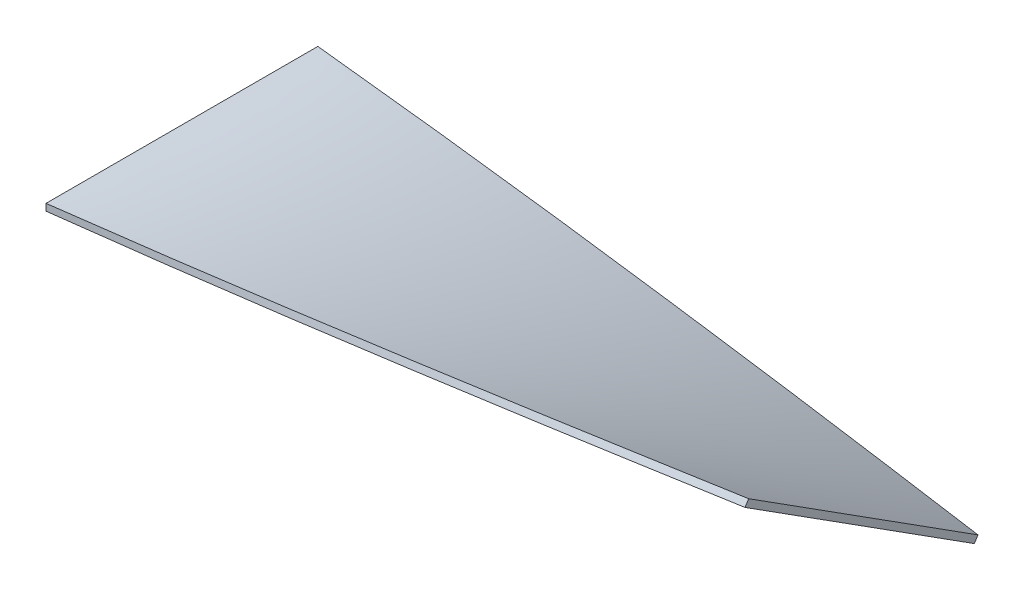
ISO-10303-21;
HEADER;
FILE_DESCRIPTION(('STEP AP214'),'2;1');
FILE_NAME('part.step','',(''),(''),'','','');
FILE_SCHEMA(('AUTOMOTIVE_DESIGN { 1 0 10303 214 1 1 1 1 }'));
ENDSEC;
DATA;
#1=APPLICATION_CONTEXT('core data for automotive mechanical design processes');
#2=APPLICATION_PROTOCOL_DEFINITION('international standard','automotive_design',2000,#1);
#3=PRODUCT_CONTEXT('',#1,'mechanical');
#4=PRODUCT('Part','Part','',(#3));
#5=PRODUCT_RELATED_PRODUCT_CATEGORY('part','',(#4));
#6=PRODUCT_DEFINITION_FORMATION('','',#4);
#7=PRODUCT_DEFINITION_CONTEXT('part definition',#1,'design');
#8=PRODUCT_DEFINITION('design','',#6,#7);
#9=PRODUCT_DEFINITION_SHAPE('','',#8);
#10=(LENGTH_UNIT() NAMED_UNIT(*) SI_UNIT(.MILLI.,.METRE.));
#11=(NAMED_UNIT(*) PLANE_ANGLE_UNIT() SI_UNIT($,.RADIAN.));
#12=(NAMED_UNIT(*) SI_UNIT($,.STERADIAN.) SOLID_ANGLE_UNIT());
#13=UNCERTAINTY_MEASURE_WITH_UNIT(LENGTH_MEASURE(1.E-05),#10,'distance_accuracy_value','');
#14=(GEOMETRIC_REPRESENTATION_CONTEXT(3) GLOBAL_UNCERTAINTY_ASSIGNED_CONTEXT((#13)) GLOBAL_UNIT_ASSIGNED_CONTEXT((#10,
#11,#12)) REPRESENTATION_CONTEXT('',''));
#15=CARTESIAN_POINT('',(0.,0.,0.));
#16=DIRECTION('',(0.,0.,1.));
#17=DIRECTION('',(1.,0.,0.));
#18=AXIS2_PLACEMENT_3D('',#15,#16,#17);
#19=CARTESIAN_POINT('',(0.,0.25,-10.));
#20=DIRECTION('',(-1.,0.,0.));
#21=DIRECTION('',(0.,0.,1.));
#22=AXIS2_PLACEMENT_3D('',#19,#20,#21);
#23=PLANE('',#22);
#24=DIRECTION('',(0.,1.,0.));
#25=VECTOR('',#24,1.);
#26=CARTESIAN_POINT('',(0.,-0.25,-10.));
#27=LINE('',#26,#25);
#28=CARTESIAN_POINT('',(0.,-0.25,-10.));
#29=VERTEX_POINT('',#28);
#30=CARTESIAN_POINT('',(0.,0.25,-10.));
#31=VERTEX_POINT('',#30);
#32=EDGE_CURVE('E79',#29,#31,#27,.T.);
#33=ORIENTED_EDGE('',*,*,#32,.F.);
#34=DIRECTION('',(0.,0.,-1.));
#35=VECTOR('',#34,1.);
#36=CARTESIAN_POINT('',(0.,-0.25,10.));
#37=LINE('',#36,#35);
#38=CARTESIAN_POINT('',(0.,-0.25,10.));
#39=VERTEX_POINT('',#38);
#40=EDGE_CURVE('E69',#39,#29,#37,.T.);
#41=ORIENTED_EDGE('',*,*,#40,.F.);
#42=DIRECTION('',(0.,-1.,0.));
#43=VECTOR('',#42,1.);
#44=CARTESIAN_POINT('',(0.,-0.25,10.));
#45=LINE('',#44,#43);
#46=CARTESIAN_POINT('',(0.,0.25,10.));
#47=VERTEX_POINT('',#46);
#48=EDGE_CURVE('E73',#47,#39,#45,.T.);
#49=ORIENTED_EDGE('',*,*,#48,.F.);
#50=DIRECTION('',(0.,0.,1.));
#51=VECTOR('',#50,1.);
#52=CARTESIAN_POINT('',(0.,0.25,10.));
#53=LINE('',#52,#51);
#54=EDGE_CURVE('E80',#31,#47,#53,.T.);
#55=ORIENTED_EDGE('',*,*,#54,.F.);
#56=EDGE_LOOP('',(#33,#41,#49,#55));
#57=FACE_BOUND('',#56,.T.);
#58=ADVANCED_FACE('F33',(#57),#23,.T.);
#59=CARTESIAN_POINT('',(50.,-5.15915702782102,-8.57004076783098));
#60=DIRECTION('',(-1.,0.,0.));
#61=DIRECTION('',(0.,0.537005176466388,0.843578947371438));
#62=AXIS2_PLACEMENT_3D('',#59,#60,#61);
#63=PLANE('',#62);
#64=DIRECTION('',(0.,0.843578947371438,-0.537005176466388));
#65=VECTOR('',#64,1.);
#66=CARTESIAN_POINT('',(50.,-5.58094650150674,-8.30153817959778));
#67=LINE('',#66,#65);
#68=CARTESIAN_POINT('',(50.0000063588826,-5.58089590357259,-8.30157249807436));
#69=VERTEX_POINT('',#68);
#70=CARTESIAN_POINT('',(50.0000063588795,-5.15910451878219,-8.57007208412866));
#71=VERTEX_POINT('',#70);
#72=EDGE_CURVE('E36',#69,#71,#67,.T.);
#73=ORIENTED_EDGE('',*,*,#72,.T.);
#74=DIRECTION('',(0.,0.537005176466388,0.843578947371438));
#75=VECTOR('',#74,1.);
#76=CARTESIAN_POINT('',(50.,5.58094650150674,8.30153817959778));
#77=LINE('',#76,#75);
#78=CARTESIAN_POINT('',(50.0000063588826,5.58089590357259,8.30157249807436));
#79=VERTEX_POINT('',#78);
#80=EDGE_CURVE('E154',#71,#79,#77,.T.);
#81=ORIENTED_EDGE('',*,*,#80,.T.);
#82=DIRECTION('',(0.,-0.843578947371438,0.537005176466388));
#83=VECTOR('',#82,1.);
#84=CARTESIAN_POINT('',(50.,5.15915702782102,8.57004076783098));
#85=LINE('',#84,#83);
#86=CARTESIAN_POINT('',(50.0000063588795,5.15910451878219,8.57007208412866));
#87=VERTEX_POINT('',#86);
#88=EDGE_CURVE('E50',#79,#87,#85,.T.);
#89=ORIENTED_EDGE('',*,*,#88,.T.);
#90=DIRECTION('',(0.,-0.537005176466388,-0.843578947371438));
#91=VECTOR('',#90,1.);
#92=CARTESIAN_POINT('',(50.,5.15915702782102,8.57004076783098));
#93=LINE('',#92,#91);
#94=EDGE_CURVE('E11',#87,#69,#93,.T.);
#95=ORIENTED_EDGE('',*,*,#94,.T.);
#96=EDGE_LOOP('',(#73,#81,#89,#95));
#97=FACE_BOUND('',#96,.T.);
#98=ADVANCED_FACE('F114',(#97),#63,.F.);
#99=CARTESIAN_POINT('',(0.,-0.25,-10.));
#100=CARTESIAN_POINT('',(9.89619985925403,-1.37672939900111,-9.97183176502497));
#101=CARTESIAN_POINT('',(19.7923997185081,-2.4689413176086,-9.69364888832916));
#102=CARTESIAN_POINT('',(29.6885995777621,-3.56115323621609,-9.41546601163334));
#103=CARTESIAN_POINT('',(39.5847994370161,-4.56407960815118,-8.9012177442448));
#104=CARTESIAN_POINT('',(49.4809992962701,-5.56700598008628,-8.38696947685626));
#105=CARTESIAN_POINT('',(59.3771991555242,-6.43035588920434,-7.66244237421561));
#106=CARTESIAN_POINT('',(69.2733990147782,-7.2937057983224,-6.93791527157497));
#107=CARTESIAN_POINT('',(79.1695988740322,-7.97418727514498,-6.03944014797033));
#108=CARTESIAN_POINT('',(0.,0.25,-10.));
#109=CARTESIAN_POINT('',(9.89619985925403,-0.87672939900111,-10.028168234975));
#110=CARTESIAN_POINT('',(19.7923997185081,-1.98147736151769,-9.80490935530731));
#111=CARTESIAN_POINT('',(29.6885995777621,-3.08622532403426,-9.5816504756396));
#112=CARTESIAN_POINT('',(39.5847994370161,-4.11359517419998,-9.11815961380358));
#113=CARTESIAN_POINT('',(49.4809992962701,-5.14096502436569,-8.65466875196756));
#114=CARTESIAN_POINT('',(59.3771991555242,-6.03944014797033,-7.97418727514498));
#115=CARTESIAN_POINT('',(69.2733990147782,-6.93791527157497,-7.2937057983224));
#116=CARTESIAN_POINT('',(79.1695988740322,-7.66244237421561,-6.43035588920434));
#117=(BOUNDED_SURFACE() B_SPLINE_SURFACE(1,2,((#99,#100,#101,#102,#103,#104,#105,#106,#107),
(#108,#109,#110,#111,#112,#113,#114,#115,#116)),.UNSPECIFIED.,.F.,.F.,
.F.) B_SPLINE_SURFACE_WITH_KNOTS((2,2),(3,2,2,2,3),(0.,1.),(0.,0.25,0.5,0.75,1.),
.UNSPECIFIED.) GEOMETRIC_REPRESENTATION_ITEM() RATIONAL_B_SPLINE_SURFACE(((1.,0.993712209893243,
1.,0.993712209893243,1.,0.993712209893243,1.,0.993712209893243,1.),(1.,0.993712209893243,1.,
0.993712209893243,1.,0.993712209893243,1.,0.993712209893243,1.))) REPRESENTATION_ITEM('') SURFACE());
#118=CARTESIAN_POINT('',(0.,0.25,-10.));
#119=CARTESIAN_POINT('',(9.89619985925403,-0.87672939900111,-10.028168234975));
#120=CARTESIAN_POINT('',(19.7923997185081,-1.98147736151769,-9.80490935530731));
#121=CARTESIAN_POINT('',(29.6885995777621,-3.08622532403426,-9.5816504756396));
#122=CARTESIAN_POINT('',(39.5847994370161,-4.11359517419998,-9.11815961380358));
#123=CARTESIAN_POINT('',(49.4809992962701,-5.14096502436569,-8.65466875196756));
#124=CARTESIAN_POINT('',(59.3771991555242,-6.03944014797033,-7.97418727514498));
#125=CARTESIAN_POINT('',(69.2733990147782,-6.93791527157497,-7.2937057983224));
#126=CARTESIAN_POINT('',(79.1695988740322,-7.66244237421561,-6.43035588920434));
#127=(BOUNDED_CURVE() B_SPLINE_CURVE(2,(#118,#119,#120,#121,#122,#123,#124,#125,#126),
.UNSPECIFIED.,.F.,.F.) B_SPLINE_CURVE_WITH_KNOTS((3,2,2,2,3),(0.,0.25,0.5,0.75,1.),
.UNSPECIFIED.) CURVE() GEOMETRIC_REPRESENTATION_ITEM() RATIONAL_B_SPLINE_CURVE((1.,
0.993712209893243,1.,0.993712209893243,1.,0.993712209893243,1.,0.993712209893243,1.)) REPRESENTATION_ITEM(''));
#128=EDGE_CURVE('E96',#31,#71,#127,.T.);
#129=CARTESIAN_POINT('',(0.,-0.25,-10.));
#130=CARTESIAN_POINT('',(9.89619985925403,-1.37672939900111,-9.97183176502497));
#131=CARTESIAN_POINT('',(19.7923997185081,-2.4689413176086,-9.69364888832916));
#132=CARTESIAN_POINT('',(29.6885995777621,-3.56115323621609,-9.41546601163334));
#133=CARTESIAN_POINT('',(39.5847994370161,-4.56407960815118,-8.9012177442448));
#134=CARTESIAN_POINT('',(49.4809992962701,-5.56700598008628,-8.38696947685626));
#135=CARTESIAN_POINT('',(59.3771991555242,-6.43035588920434,-7.66244237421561));
#136=CARTESIAN_POINT('',(69.2733990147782,-7.2937057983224,-6.93791527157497));
#137=CARTESIAN_POINT('',(79.1695988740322,-7.97418727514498,-6.03944014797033));
#138=(BOUNDED_CURVE() B_SPLINE_CURVE(2,(#129,#130,#131,#132,#133,#134,#135,#136,#137),
.UNSPECIFIED.,.F.,.F.) B_SPLINE_CURVE_WITH_KNOTS((3,2,2,2,3),(0.,0.25,0.5,0.75,1.),
.UNSPECIFIED.) CURVE() GEOMETRIC_REPRESENTATION_ITEM() RATIONAL_B_SPLINE_CURVE((1.,
0.993712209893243,1.,0.993712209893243,1.,0.993712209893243,1.,0.993712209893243,1.)) REPRESENTATION_ITEM(''));
#139=EDGE_CURVE('E90',#29,#69,#138,.T.);
#140=ORIENTED_EDGE('',*,*,#128,.T.);
#141=ORIENTED_EDGE('',*,*,#72,.F.);
#142=ORIENTED_EDGE('',*,*,#139,.F.);
#143=ORIENTED_EDGE('',*,*,#32,.T.);
#144=EDGE_LOOP('',(#140,#141,#142,#143));
#145=FACE_BOUND('',#144,.T.);
#146=ADVANCED_FACE('F93',(#145),#117,.T.);
#147=CARTESIAN_POINT('',(0.,0.25,-10.));
#148=CARTESIAN_POINT('',(9.89619985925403,-0.87672939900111,-10.028168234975));
#149=CARTESIAN_POINT('',(19.7923997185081,-1.98147736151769,-9.80490935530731));
#150=CARTESIAN_POINT('',(29.6885995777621,-3.08622532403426,-9.5816504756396));
#151=CARTESIAN_POINT('',(39.5847994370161,-4.11359517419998,-9.11815961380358));
#152=CARTESIAN_POINT('',(49.4809992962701,-5.14096502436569,-8.65466875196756));
#153=CARTESIAN_POINT('',(59.3771991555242,-6.03944014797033,-7.97418727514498));
#154=CARTESIAN_POINT('',(69.2733990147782,-6.93791527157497,-7.2937057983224));
#155=CARTESIAN_POINT('',(79.1695988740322,-7.66244237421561,-6.43035588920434));
#156=CARTESIAN_POINT('',(0.,0.25,10.));
#157=CARTESIAN_POINT('',(9.89619985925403,1.37672939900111,9.97183176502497));
#158=CARTESIAN_POINT('',(19.7923997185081,2.4689413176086,9.69364888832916));
#159=CARTESIAN_POINT('',(29.6885995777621,3.56115323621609,9.41546601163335));
#160=CARTESIAN_POINT('',(39.5847994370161,4.56407960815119,8.9012177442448));
#161=CARTESIAN_POINT('',(49.4809992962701,5.56700598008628,8.38696947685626));
#162=CARTESIAN_POINT('',(59.3771991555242,6.43035588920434,7.66244237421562));
#163=CARTESIAN_POINT('',(69.2733990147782,7.2937057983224,6.93791527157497));
#164=CARTESIAN_POINT('',(79.1695988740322,7.97418727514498,6.03944014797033));
#165=(BOUNDED_SURFACE() B_SPLINE_SURFACE(1,2,((#147,#148,#149,#150,#151,#152,#153,#154,#155),
(#156,#157,#158,#159,#160,#161,#162,#163,#164)),.UNSPECIFIED.,.F.,.F.,
.F.) B_SPLINE_SURFACE_WITH_KNOTS((2,2),(3,2,2,2,3),(0.,1.),(0.,0.25,0.5,0.75,1.),
.UNSPECIFIED.) GEOMETRIC_REPRESENTATION_ITEM() RATIONAL_B_SPLINE_SURFACE(((1.,0.993712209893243,
1.,0.993712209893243,1.,0.993712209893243,1.,0.993712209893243,1.),(1.,0.993712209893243,1.,
0.993712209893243,1.,0.993712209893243,1.,0.993712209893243,1.))) REPRESENTATION_ITEM('') SURFACE());
#166=CARTESIAN_POINT('',(0.,0.25,10.));
#167=CARTESIAN_POINT('',(9.89619985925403,1.37672939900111,9.97183176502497));
#168=CARTESIAN_POINT('',(19.7923997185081,2.4689413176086,9.69364888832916));
#169=CARTESIAN_POINT('',(29.6885995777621,3.56115323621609,9.41546601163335));
#170=CARTESIAN_POINT('',(39.5847994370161,4.56407960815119,8.9012177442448));
#171=CARTESIAN_POINT('',(49.4809992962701,5.56700598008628,8.38696947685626));
#172=CARTESIAN_POINT('',(59.3771991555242,6.43035588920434,7.66244237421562));
#173=CARTESIAN_POINT('',(69.2733990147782,7.2937057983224,6.93791527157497));
#174=CARTESIAN_POINT('',(79.1695988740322,7.97418727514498,6.03944014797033));
#175=(BOUNDED_CURVE() B_SPLINE_CURVE(2,(#166,#167,#168,#169,#170,#171,#172,#173,#174),
.UNSPECIFIED.,.F.,.F.) B_SPLINE_CURVE_WITH_KNOTS((3,2,2,2,3),(0.,0.25,0.5,0.75,1.),
.UNSPECIFIED.) CURVE() GEOMETRIC_REPRESENTATION_ITEM() RATIONAL_B_SPLINE_CURVE((1.,
0.993712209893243,1.,0.993712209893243,1.,0.993712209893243,1.,0.993712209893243,1.)) REPRESENTATION_ITEM(''));
#176=EDGE_CURVE('E144',#47,#79,#175,.T.);
#177=ORIENTED_EDGE('',*,*,#176,.T.);
#178=ORIENTED_EDGE('',*,*,#80,.F.);
#179=ORIENTED_EDGE('',*,*,#128,.F.);
#180=ORIENTED_EDGE('',*,*,#54,.T.);
#181=EDGE_LOOP('',(#177,#178,#179,#180));
#182=FACE_BOUND('',#181,.T.);
#183=ADVANCED_FACE('F204',(#182),#165,.T.);
#184=CARTESIAN_POINT('',(0.,0.25,10.));
#185=CARTESIAN_POINT('',(9.89619985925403,1.37672939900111,9.97183176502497));
#186=CARTESIAN_POINT('',(19.7923997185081,2.4689413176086,9.69364888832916));
#187=CARTESIAN_POINT('',(29.6885995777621,3.56115323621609,9.41546601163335));
#188=CARTESIAN_POINT('',(39.5847994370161,4.56407960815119,8.9012177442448));
#189=CARTESIAN_POINT('',(49.4809992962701,5.56700598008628,8.38696947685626));
#190=CARTESIAN_POINT('',(59.3771991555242,6.43035588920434,7.66244237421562));
#191=CARTESIAN_POINT('',(69.2733990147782,7.2937057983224,6.93791527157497));
#192=CARTESIAN_POINT('',(79.1695988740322,7.97418727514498,6.03944014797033));
#193=CARTESIAN_POINT('',(0.,-0.25,10.));
#194=CARTESIAN_POINT('',(9.89619985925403,0.876729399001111,10.028168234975));
#195=CARTESIAN_POINT('',(19.7923997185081,1.98147736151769,9.80490935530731));
#196=CARTESIAN_POINT('',(29.6885995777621,3.08622532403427,9.5816504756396));
#197=CARTESIAN_POINT('',(39.5847994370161,4.11359517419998,9.11815961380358));
#198=CARTESIAN_POINT('',(49.4809992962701,5.14096502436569,8.65466875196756));
#199=CARTESIAN_POINT('',(59.3771991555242,6.03944014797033,7.97418727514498));
#200=CARTESIAN_POINT('',(69.2733990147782,6.93791527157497,7.2937057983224));
#201=CARTESIAN_POINT('',(79.1695988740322,7.66244237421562,6.43035588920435));
#202=(BOUNDED_SURFACE() B_SPLINE_SURFACE(1,2,((#184,#185,#186,#187,#188,#189,#190,#191,#192),
(#193,#194,#195,#196,#197,#198,#199,#200,#201)),.UNSPECIFIED.,.F.,.F.,
.F.) B_SPLINE_SURFACE_WITH_KNOTS((2,2),(3,2,2,2,3),(0.,1.),(0.,0.25,0.5,0.75,1.),
.UNSPECIFIED.) GEOMETRIC_REPRESENTATION_ITEM() RATIONAL_B_SPLINE_SURFACE(((1.,0.993712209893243,
1.,0.993712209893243,1.,0.993712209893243,1.,0.993712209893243,1.),(1.,0.993712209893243,1.,
0.993712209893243,1.,0.993712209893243,1.,0.993712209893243,1.))) REPRESENTATION_ITEM('') SURFACE());
#203=CARTESIAN_POINT('',(0.,-0.25,10.));
#204=CARTESIAN_POINT('',(9.89619985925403,0.876729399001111,10.028168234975));
#205=CARTESIAN_POINT('',(19.7923997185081,1.98147736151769,9.80490935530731));
#206=CARTESIAN_POINT('',(29.6885995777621,3.08622532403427,9.5816504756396));
#207=CARTESIAN_POINT('',(39.5847994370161,4.11359517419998,9.11815961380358));
#208=CARTESIAN_POINT('',(49.4809992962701,5.14096502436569,8.65466875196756));
#209=CARTESIAN_POINT('',(59.3771991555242,6.03944014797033,7.97418727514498));
#210=CARTESIAN_POINT('',(69.2733990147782,6.93791527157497,7.2937057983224));
#211=CARTESIAN_POINT('',(79.1695988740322,7.66244237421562,6.43035588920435));
#212=(BOUNDED_CURVE() B_SPLINE_CURVE(2,(#203,#204,#205,#206,#207,#208,#209,#210,#211),
.UNSPECIFIED.,.F.,.F.) B_SPLINE_CURVE_WITH_KNOTS((3,2,2,2,3),(0.,0.25,0.5,0.75,1.),
.UNSPECIFIED.) CURVE() GEOMETRIC_REPRESENTATION_ITEM() RATIONAL_B_SPLINE_CURVE((1.,
0.993712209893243,1.,0.993712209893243,1.,0.993712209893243,1.,0.993712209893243,1.)) REPRESENTATION_ITEM(''));
#213=EDGE_CURVE('E43',#39,#87,#212,.T.);
#214=ORIENTED_EDGE('',*,*,#213,.T.);
#215=ORIENTED_EDGE('',*,*,#88,.F.);
#216=ORIENTED_EDGE('',*,*,#176,.F.);
#217=ORIENTED_EDGE('',*,*,#48,.T.);
#218=EDGE_LOOP('',(#214,#215,#216,#217));
#219=FACE_BOUND('',#218,.T.);
#220=ADVANCED_FACE('F181',(#219),#202,.T.);
#221=CARTESIAN_POINT('',(0.,-0.25,10.));
#222=CARTESIAN_POINT('',(9.89619985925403,0.876729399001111,10.028168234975));
#223=CARTESIAN_POINT('',(19.7923997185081,1.98147736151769,9.80490935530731));
#224=CARTESIAN_POINT('',(29.6885995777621,3.08622532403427,9.5816504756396));
#225=CARTESIAN_POINT('',(39.5847994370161,4.11359517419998,9.11815961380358));
#226=CARTESIAN_POINT('',(49.4809992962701,5.14096502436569,8.65466875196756));
#227=CARTESIAN_POINT('',(59.3771991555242,6.03944014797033,7.97418727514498));
#228=CARTESIAN_POINT('',(69.2733990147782,6.93791527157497,7.2937057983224));
#229=CARTESIAN_POINT('',(79.1695988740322,7.66244237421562,6.43035588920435));
#230=CARTESIAN_POINT('',(0.,-0.25,-10.));
#231=CARTESIAN_POINT('',(9.89619985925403,-1.37672939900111,-9.97183176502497));
#232=CARTESIAN_POINT('',(19.7923997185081,-2.4689413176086,-9.69364888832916));
#233=CARTESIAN_POINT('',(29.6885995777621,-3.56115323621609,-9.41546601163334));
#234=CARTESIAN_POINT('',(39.5847994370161,-4.56407960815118,-8.9012177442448));
#235=CARTESIAN_POINT('',(49.4809992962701,-5.56700598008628,-8.38696947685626));
#236=CARTESIAN_POINT('',(59.3771991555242,-6.43035588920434,-7.66244237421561));
#237=CARTESIAN_POINT('',(69.2733990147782,-7.2937057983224,-6.93791527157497));
#238=CARTESIAN_POINT('',(79.1695988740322,-7.97418727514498,-6.03944014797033));
#239=(BOUNDED_SURFACE() B_SPLINE_SURFACE(1,2,((#221,#222,#223,#224,#225,#226,#227,#228,#229),
(#230,#231,#232,#233,#234,#235,#236,#237,#238)),.UNSPECIFIED.,.F.,.F.,
.F.) B_SPLINE_SURFACE_WITH_KNOTS((2,2),(3,2,2,2,3),(0.,1.),(0.,0.25,0.5,0.75,1.),
.UNSPECIFIED.) GEOMETRIC_REPRESENTATION_ITEM() RATIONAL_B_SPLINE_SURFACE(((1.,0.993712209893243,
1.,0.993712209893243,1.,0.993712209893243,1.,0.993712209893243,1.),(1.,0.993712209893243,1.,
0.993712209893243,1.,0.993712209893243,1.,0.993712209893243,1.))) REPRESENTATION_ITEM('') SURFACE());
#240=ORIENTED_EDGE('',*,*,#94,.F.);
#241=ORIENTED_EDGE('',*,*,#213,.F.);
#242=ORIENTED_EDGE('',*,*,#40,.T.);
#243=ORIENTED_EDGE('',*,*,#139,.T.);
#244=EDGE_LOOP('',(#240,#241,#242,#243));
#245=FACE_BOUND('',#244,.T.);
#246=ADVANCED_FACE('F89',(#245),#239,.T.);
#247=CLOSED_SHELL('',(#58,#98,#146,#183,#220,#246));
#248=MANIFOLD_SOLID_BREP('B2',#247);
#249=ADVANCED_BREP_SHAPE_REPRESENTATION('',(#18,#248),#14);
#250=SHAPE_DEFINITION_REPRESENTATION(#9,#249);
ENDSEC;
END-ISO-10303-21;
